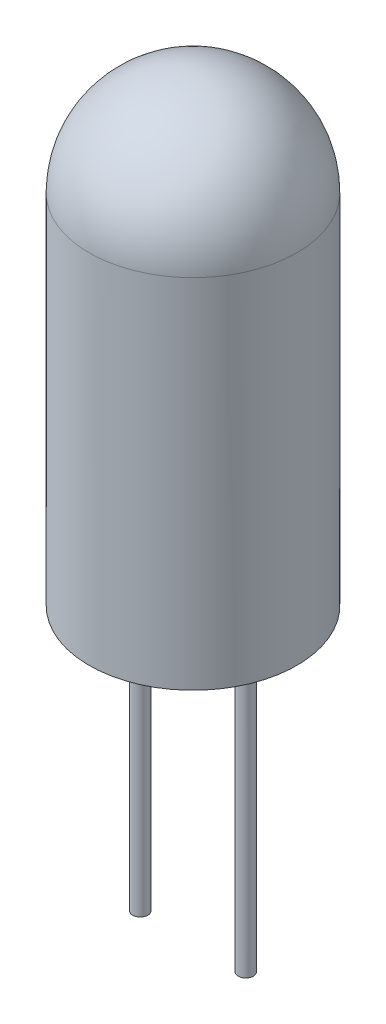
ISO-10303-21;
HEADER;
FILE_DESCRIPTION(('STEP AP214'),'2;1');
FILE_NAME('part.step','',(''),(''),'','','');
FILE_SCHEMA(('AUTOMOTIVE_DESIGN { 1 0 10303 214 1 1 1 1 }'));
ENDSEC;
DATA;
#1=APPLICATION_CONTEXT('core data for automotive mechanical design processes');
#2=APPLICATION_PROTOCOL_DEFINITION('international standard','automotive_design',2000,#1);
#3=PRODUCT_CONTEXT('',#1,'mechanical');
#4=PRODUCT('Part','Part','',(#3));
#5=PRODUCT_RELATED_PRODUCT_CATEGORY('part','',(#4));
#6=PRODUCT_DEFINITION_FORMATION('','',#4);
#7=PRODUCT_DEFINITION_CONTEXT('part definition',#1,'design');
#8=PRODUCT_DEFINITION('design','',#6,#7);
#9=PRODUCT_DEFINITION_SHAPE('','',#8);
#10=(LENGTH_UNIT() NAMED_UNIT(*) SI_UNIT(.MILLI.,.METRE.));
#11=(NAMED_UNIT(*) PLANE_ANGLE_UNIT() SI_UNIT($,.RADIAN.));
#12=(NAMED_UNIT(*) SI_UNIT($,.STERADIAN.) SOLID_ANGLE_UNIT());
#13=UNCERTAINTY_MEASURE_WITH_UNIT(LENGTH_MEASURE(1.E-05),#10,'distance_accuracy_value','');
#14=(GEOMETRIC_REPRESENTATION_CONTEXT(3) GLOBAL_UNCERTAINTY_ASSIGNED_CONTEXT((#13)) GLOBAL_UNIT_ASSIGNED_CONTEXT((#10,
#11,#12)) REPRESENTATION_CONTEXT('',''));
#15=CARTESIAN_POINT('',(0.,0.,0.));
#16=DIRECTION('',(0.,0.,1.));
#17=DIRECTION('',(1.,0.,0.));
#18=AXIS2_PLACEMENT_3D('',#15,#16,#17);
#19=CARTESIAN_POINT('',(0.,-8.6,0.));
#20=DIRECTION('',(0.,1.,0.));
#21=DIRECTION('',(-1.,0.,0.));
#22=AXIS2_PLACEMENT_3D('',#19,#20,#21);
#23=PLANE('',#22);
#24=CARTESIAN_POINT('',(1.27000000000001,-8.6,0.));
#25=DIRECTION('',(0.,1.,0.));
#26=DIRECTION('',(-1.,0.,0.));
#27=AXIS2_PLACEMENT_3D('',#24,#25,#26);
#28=CIRCLE('',#27,0.182921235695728);
#29=CARTESIAN_POINT('',(1.08707876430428,-8.6,0.));
#30=VERTEX_POINT('',#29);
#31=EDGE_CURVE('E39',#30,#30,#28,.F.);
#32=ORIENTED_EDGE('',*,*,#31,.F.);
#33=EDGE_LOOP('',(#32));
#34=FACE_BOUND('',#33,.T.);
#35=CARTESIAN_POINT('',(0.,-8.6,0.));
#36=DIRECTION('',(0.,1.,0.));
#37=DIRECTION('',(-1.,0.,0.));
#38=AXIS2_PLACEMENT_3D('',#35,#36,#37);
#39=CIRCLE('',#38,2.5);
#40=CARTESIAN_POINT('',(-2.49999999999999,-8.6,0.));
#41=VERTEX_POINT('',#40);
#42=EDGE_CURVE('E43',#41,#41,#39,.T.);
#43=ORIENTED_EDGE('',*,*,#42,.F.);
#44=EDGE_LOOP('',(#43));
#45=FACE_BOUND('',#44,.T.);
#46=CARTESIAN_POINT('',(-1.27,-8.6,0.));
#47=DIRECTION('',(0.,1.,0.));
#48=DIRECTION('',(-1.,0.,0.));
#49=AXIS2_PLACEMENT_3D('',#46,#47,#48);
#50=CIRCLE('',#49,0.182921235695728);
#51=CARTESIAN_POINT('',(-1.45292123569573,-8.6,0.));
#52=VERTEX_POINT('',#51);
#53=EDGE_CURVE('E10',#52,#52,#50,.F.);
#54=ORIENTED_EDGE('',*,*,#53,.F.);
#55=EDGE_LOOP('',(#54));
#56=FACE_BOUND('',#55,.T.);
#57=ADVANCED_FACE('F32',(#34,#45,#56),#23,.F.);
#58=CARTESIAN_POINT('',(0.,0.,0.));
#59=DIRECTION('',(0.,1.,0.));
#60=DIRECTION('',(1.,0.,0.));
#61=AXIS2_PLACEMENT_3D('',#58,#59,#60);
#62=SPHERICAL_SURFACE('',#61,2.5);
#63=CARTESIAN_POINT('',(0.,0.,0.));
#64=DIRECTION('',(0.,1.,0.));
#65=DIRECTION('',(-1.,0.,0.));
#66=AXIS2_PLACEMENT_3D('',#63,#64,#65);
#67=CIRCLE('',#66,2.49999999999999);
#68=CARTESIAN_POINT('',(-2.5,0.,0.));
#69=VERTEX_POINT('',#68);
#70=EDGE_CURVE('E47',#69,#69,#67,.T.);
#71=ORIENTED_EDGE('',*,*,#70,.T.);
#72=EDGE_LOOP('',(#71));
#73=FACE_BOUND('',#72,.T.);
#74=ADVANCED_FACE('F34',(#73),#62,.T.);
#75=CARTESIAN_POINT('',(0.,2.49999999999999,0.));
#76=DIRECTION('',(0.,1.,0.));
#77=DIRECTION('',(-1.,0.,0.));
#78=AXIS2_PLACEMENT_3D('',#75,#76,#77);
#79=CYLINDRICAL_SURFACE('',#78,2.5);
#80=ORIENTED_EDGE('',*,*,#70,.F.);
#81=EDGE_LOOP('',(#80));
#82=FACE_BOUND('',#81,.T.);
#83=ORIENTED_EDGE('',*,*,#42,.T.);
#84=EDGE_LOOP('',(#83));
#85=FACE_BOUND('',#84,.T.);
#86=ADVANCED_FACE('F78',(#82,#85),#79,.T.);
#87=CARTESIAN_POINT('',(1.27000000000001,-15.6,0.));
#88=DIRECTION('',(0.,1.,0.));
#89=DIRECTION('',(-1.,0.,0.));
#90=AXIS2_PLACEMENT_3D('',#87,#88,#89);
#91=CYLINDRICAL_SURFACE('',#90,0.182921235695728);
#92=CARTESIAN_POINT('',(1.27000000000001,-15.6,0.));
#93=DIRECTION('',(0.,-1.,0.));
#94=DIRECTION('',(1.,0.,0.));
#95=AXIS2_PLACEMENT_3D('',#92,#93,#94);
#96=CIRCLE('',#95,0.182921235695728);
#97=CARTESIAN_POINT('',(1.45292123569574,-15.6,0.));
#98=VERTEX_POINT('',#97);
#99=EDGE_CURVE('E52',#98,#98,#96,.T.);
#100=ORIENTED_EDGE('',*,*,#99,.F.);
#101=EDGE_LOOP('',(#100));
#102=FACE_BOUND('',#101,.T.);
#103=ORIENTED_EDGE('',*,*,#31,.T.);
#104=EDGE_LOOP('',(#103));
#105=FACE_BOUND('',#104,.T.);
#106=ADVANCED_FACE('F70',(#102,#105),#91,.T.);
#107=CARTESIAN_POINT('',(1.27000000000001,-15.6,0.));
#108=DIRECTION('',(0.,-1.,0.));
#109=DIRECTION('',(1.,0.,0.));
#110=AXIS2_PLACEMENT_3D('',#107,#108,#109);
#111=PLANE('',#110);
#112=ORIENTED_EDGE('',*,*,#99,.T.);
#113=EDGE_LOOP('',(#112));
#114=FACE_BOUND('',#113,.T.);
#115=ADVANCED_FACE('F63',(#114),#111,.T.);
#116=CARTESIAN_POINT('',(-1.27,-15.6,0.));
#117=DIRECTION('',(0.,1.,0.));
#118=DIRECTION('',(-1.,0.,0.));
#119=AXIS2_PLACEMENT_3D('',#116,#117,#118);
#120=CYLINDRICAL_SURFACE('',#119,0.182921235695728);
#121=CARTESIAN_POINT('',(-1.27,-15.6,0.));
#122=DIRECTION('',(0.,-1.,0.));
#123=DIRECTION('',(-1.,0.,0.));
#124=AXIS2_PLACEMENT_3D('',#121,#122,#123);
#125=CIRCLE('',#124,0.182921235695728);
#126=CARTESIAN_POINT('',(-1.45292123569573,-15.6,0.));
#127=VERTEX_POINT('',#126);
#128=EDGE_CURVE('E55',#127,#127,#125,.T.);
#129=ORIENTED_EDGE('',*,*,#128,.F.);
#130=EDGE_LOOP('',(#129));
#131=FACE_BOUND('',#130,.T.);
#132=ORIENTED_EDGE('',*,*,#53,.T.);
#133=EDGE_LOOP('',(#132));
#134=FACE_BOUND('',#133,.T.);
#135=ADVANCED_FACE('F61',(#131,#134),#120,.T.);
#136=CARTESIAN_POINT('',(-1.27,-15.6,0.));
#137=DIRECTION('',(0.,1.,0.));
#138=DIRECTION('',(-1.,0.,0.));
#139=AXIS2_PLACEMENT_3D('',#136,#137,#138);
#140=PLANE('',#139);
#141=ORIENTED_EDGE('',*,*,#128,.T.);
#142=EDGE_LOOP('',(#141));
#143=FACE_BOUND('',#142,.T.);
#144=ADVANCED_FACE('F59',(#143),#140,.F.);
#145=CLOSED_SHELL('',(#57,#74,#86,#106,#115,#135,#144));
#146=MANIFOLD_SOLID_BREP('B2',#145);
#147=ADVANCED_BREP_SHAPE_REPRESENTATION('',(#18,#146),#14);
#148=SHAPE_DEFINITION_REPRESENTATION(#9,#147);
ENDSEC;
END-ISO-10303-21;
